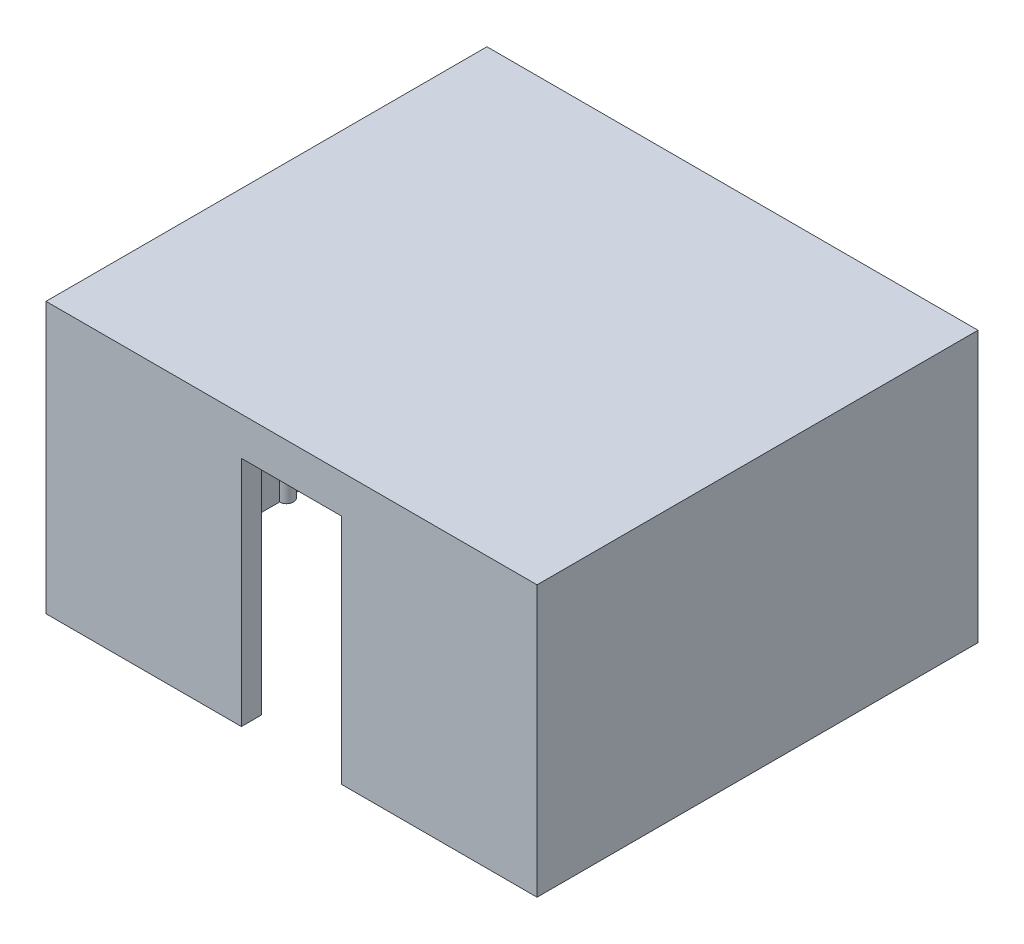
from build123d import *

# Parameters (mm, degrees)
SKETCH1_W           = 49
SKETCH1_H           = 44
BOSS_EXTRUDE1_DEPTH = 27
SHELL1_T            = -2
SKETCH2_W           = 10
SKETCH2_H           = 23.183467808
CUT_EXTRUDE2_DEPTH  = 10
SKETCH4_R           = 0.7
BOSS_EXTRUDE3_DEPTH = 25


with BuildPart() as part:
    # Sketch1 → Boss-Extrude1 (new body)
    with BuildSketch(Plane(origin=(0, 0, 0), x_dir=(1, 0, 0), z_dir=(0, 1, 0))):
        with Locations((-24.5, 22)):
            Rectangle(SKETCH1_W, SKETCH1_H)
    extrude(amount=BOSS_EXTRUDE1_DEPTH)

    # Shell1
    shell1_openings = [part.faces().sort_by_distance(p)[0] for p in [
        (-24.5, 0, -22),
    ]]
    offset(amount=SHELL1_T, openings=shell1_openings, kind=Kind.INTERSECTION)

    # Sketch2 → Cut-Extrude2 (cut)
    with BuildSketch(Plane.XY):
        with Locations((-24.5, 11.591733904)):
            Rectangle(SKETCH2_W, SKETCH2_H)
    extrude(amount=-CUT_EXTRUDE2_DEPTH, mode=Mode.SUBTRACT)

    # Sketch4 → Boss-Extrude3 (add)
    with BuildSketch(Plane.XZ.offset(-25)):
        with Locations((-47, -22)):
            Circle(SKETCH4_R)
        with Locations((-24.5, -42)):
            Circle(SKETCH4_R)
        with Locations((-10.75, -2)):
            Circle(SKETCH4_R)
        with Locations((-38.25, -2)):
            Circle(SKETCH4_R)
        with Locations((-2, -22)):
            Circle(SKETCH4_R)
    extrude(amount=BOSS_EXTRUDE3_DEPTH)


solid = part.part
